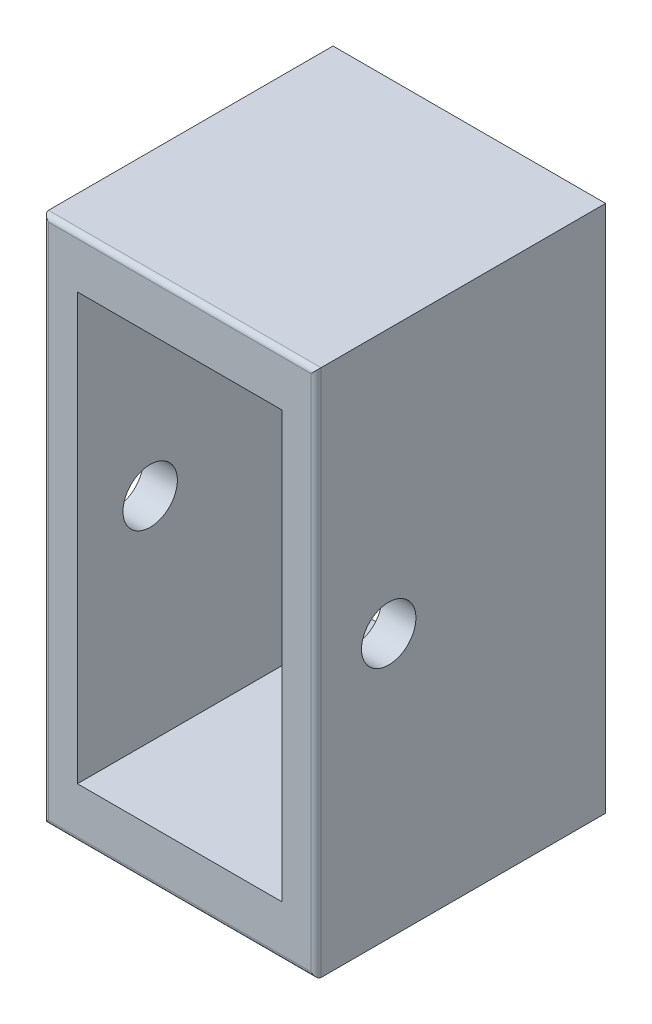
ISO-10303-21;
HEADER;
FILE_DESCRIPTION(('STEP AP214'),'2;1');
FILE_NAME('part.step','',(''),(''),'','','');
FILE_SCHEMA(('AUTOMOTIVE_DESIGN { 1 0 10303 214 1 1 1 1 }'));
ENDSEC;
DATA;
#1=APPLICATION_CONTEXT('core data for automotive mechanical design processes');
#2=APPLICATION_PROTOCOL_DEFINITION('international standard','automotive_design',2000,#1);
#3=PRODUCT_CONTEXT('',#1,'mechanical');
#4=PRODUCT('Part','Part','',(#3));
#5=PRODUCT_RELATED_PRODUCT_CATEGORY('part','',(#4));
#6=PRODUCT_DEFINITION_FORMATION('','',#4);
#7=PRODUCT_DEFINITION_CONTEXT('part definition',#1,'design');
#8=PRODUCT_DEFINITION('design','',#6,#7);
#9=PRODUCT_DEFINITION_SHAPE('','',#8);
#10=(LENGTH_UNIT() NAMED_UNIT(*) SI_UNIT(.MILLI.,.METRE.));
#11=(NAMED_UNIT(*) PLANE_ANGLE_UNIT() SI_UNIT($,.RADIAN.));
#12=(NAMED_UNIT(*) SI_UNIT($,.STERADIAN.) SOLID_ANGLE_UNIT());
#13=UNCERTAINTY_MEASURE_WITH_UNIT(LENGTH_MEASURE(1.E-05),#10,'distance_accuracy_value','');
#14=(GEOMETRIC_REPRESENTATION_CONTEXT(3) GLOBAL_UNCERTAINTY_ASSIGNED_CONTEXT((#13)) GLOBAL_UNIT_ASSIGNED_CONTEXT((#10,
#11,#12)) REPRESENTATION_CONTEXT('',''));
#15=CARTESIAN_POINT('',(0.,0.,0.));
#16=DIRECTION('',(0.,0.,1.));
#17=DIRECTION('',(1.,0.,0.));
#18=AXIS2_PLACEMENT_3D('',#15,#16,#17);
#19=CARTESIAN_POINT('',(0.,31.,17.));
#20=DIRECTION('',(0.,0.,-1.));
#21=DIRECTION('',(-1.,0.,0.));
#22=AXIS2_PLACEMENT_3D('',#19,#20,#21);
#23=PLANE('',#22);
#24=DIRECTION('',(-1.,0.,0.));
#25=VECTOR('',#24,1.);
#26=CARTESIAN_POINT('',(0.,30.7,17.));
#27=LINE('',#26,#25);
#28=CARTESIAN_POINT('',(15.7,30.7,17.));
#29=VERTEX_POINT('',#28);
#30=CARTESIAN_POINT('',(0.3,30.7,17.));
#31=VERTEX_POINT('',#30);
#32=EDGE_CURVE('E175',#29,#31,#27,.T.);
#33=ORIENTED_EDGE('',*,*,#32,.T.);
#34=DIRECTION('',(0.,-1.,0.));
#35=VECTOR('',#34,1.);
#36=CARTESIAN_POINT('',(0.3,31.,17.));
#37=LINE('',#36,#35);
#38=CARTESIAN_POINT('',(0.3,0.300000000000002,17.));
#39=VERTEX_POINT('',#38);
#40=EDGE_CURVE('E181',#31,#39,#37,.T.);
#41=ORIENTED_EDGE('',*,*,#40,.T.);
#42=DIRECTION('',(1.,0.,0.));
#43=VECTOR('',#42,1.);
#44=CARTESIAN_POINT('',(0.,0.300000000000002,17.));
#45=LINE('',#44,#43);
#46=CARTESIAN_POINT('',(15.7,0.300000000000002,17.));
#47=VERTEX_POINT('',#46);
#48=EDGE_CURVE('E179',#39,#47,#45,.T.);
#49=ORIENTED_EDGE('',*,*,#48,.T.);
#50=DIRECTION('',(0.,1.,0.));
#51=VECTOR('',#50,1.);
#52=CARTESIAN_POINT('',(15.7,31.,17.));
#53=LINE('',#52,#51);
#54=EDGE_CURVE('E177',#47,#29,#53,.T.);
#55=ORIENTED_EDGE('',*,*,#54,.T.);
#56=EDGE_LOOP('',(#33,#41,#49,#55));
#57=FACE_BOUND('',#56,.T.);
#58=DIRECTION('',(-1.,0.,0.));
#59=VECTOR('',#58,1.);
#60=CARTESIAN_POINT('',(2.,28.,17.));
#61=LINE('',#60,#59);
#62=CARTESIAN_POINT('',(14.,28.,17.));
#63=VERTEX_POINT('',#62);
#64=CARTESIAN_POINT('',(2.,28.,17.));
#65=VERTEX_POINT('',#64);
#66=EDGE_CURVE('E127',#63,#65,#61,.T.);
#67=ORIENTED_EDGE('',*,*,#66,.F.);
#68=DIRECTION('',(0.,1.,0.));
#69=VECTOR('',#68,1.);
#70=CARTESIAN_POINT('',(14.,3.,17.));
#71=LINE('',#70,#69);
#72=CARTESIAN_POINT('',(14.,3.,17.));
#73=VERTEX_POINT('',#72);
#74=EDGE_CURVE('E149',#73,#63,#71,.T.);
#75=ORIENTED_EDGE('',*,*,#74,.F.);
#76=DIRECTION('',(1.,0.,0.));
#77=VECTOR('',#76,1.);
#78=CARTESIAN_POINT('',(2.,3.,17.));
#79=LINE('',#78,#77);
#80=CARTESIAN_POINT('',(2.,3.,17.));
#81=VERTEX_POINT('',#80);
#82=EDGE_CURVE('E146',#81,#73,#79,.T.);
#83=ORIENTED_EDGE('',*,*,#82,.F.);
#84=DIRECTION('',(0.,-1.,0.));
#85=VECTOR('',#84,1.);
#86=CARTESIAN_POINT('',(2.,3.,17.));
#87=LINE('',#86,#85);
#88=EDGE_CURVE('E144',#65,#81,#87,.T.);
#89=ORIENTED_EDGE('',*,*,#88,.F.);
#90=EDGE_LOOP('',(#67,#75,#83,#89));
#91=FACE_BOUND('',#90,.T.);
#92=ADVANCED_FACE('F32',(#57,#91),#23,.F.);
#93=CARTESIAN_POINT('',(0.,31.,0.));
#94=DIRECTION('',(0.,0.,-1.));
#95=DIRECTION('',(-1.,0.,0.));
#96=AXIS2_PLACEMENT_3D('',#93,#94,#95);
#97=PLANE('',#96);
#98=DIRECTION('',(0.,-1.,0.));
#99=VECTOR('',#98,1.);
#100=CARTESIAN_POINT('',(0.,0.,0.));
#101=LINE('',#100,#99);
#102=CARTESIAN_POINT('',(0.,31.,0.));
#103=VERTEX_POINT('',#102);
#104=CARTESIAN_POINT('',(0.,0.,0.));
#105=VERTEX_POINT('',#104);
#106=EDGE_CURVE('E128',#103,#105,#101,.T.);
#107=ORIENTED_EDGE('',*,*,#106,.F.);
#108=DIRECTION('',(-1.,0.,0.));
#109=VECTOR('',#108,1.);
#110=CARTESIAN_POINT('',(0.,31.,0.));
#111=LINE('',#110,#109);
#112=CARTESIAN_POINT('',(16.,31.,0.));
#113=VERTEX_POINT('',#112);
#114=EDGE_CURVE('E164',#113,#103,#111,.T.);
#115=ORIENTED_EDGE('',*,*,#114,.F.);
#116=DIRECTION('',(0.,1.,0.));
#117=VECTOR('',#116,1.);
#118=CARTESIAN_POINT('',(16.,0.,0.));
#119=LINE('',#118,#117);
#120=CARTESIAN_POINT('',(16.,0.,0.));
#121=VERTEX_POINT('',#120);
#122=EDGE_CURVE('E161',#121,#113,#119,.T.);
#123=ORIENTED_EDGE('',*,*,#122,.F.);
#124=DIRECTION('',(1.,0.,0.));
#125=VECTOR('',#124,1.);
#126=CARTESIAN_POINT('',(0.,0.,0.));
#127=LINE('',#126,#125);
#128=EDGE_CURVE('E158',#105,#121,#127,.T.);
#129=ORIENTED_EDGE('',*,*,#128,.F.);
#130=EDGE_LOOP('',(#107,#115,#123,#129));
#131=FACE_BOUND('',#130,.T.);
#132=DIRECTION('',(0.,1.,0.));
#133=VECTOR('',#132,1.);
#134=CARTESIAN_POINT('',(14.,3.,0.));
#135=LINE('',#134,#133);
#136=CARTESIAN_POINT('',(14.,3.,0.));
#137=VERTEX_POINT('',#136);
#138=CARTESIAN_POINT('',(14.,28.,0.));
#139=VERTEX_POINT('',#138);
#140=EDGE_CURVE('E133',#137,#139,#135,.T.);
#141=ORIENTED_EDGE('',*,*,#140,.T.);
#142=DIRECTION('',(-1.,0.,0.));
#143=VECTOR('',#142,1.);
#144=CARTESIAN_POINT('',(2.,28.,0.));
#145=LINE('',#144,#143);
#146=CARTESIAN_POINT('',(2.,28.,0.));
#147=VERTEX_POINT('',#146);
#148=EDGE_CURVE('E120',#139,#147,#145,.T.);
#149=ORIENTED_EDGE('',*,*,#148,.T.);
#150=DIRECTION('',(0.,-1.,0.));
#151=VECTOR('',#150,1.);
#152=CARTESIAN_POINT('',(2.,3.,0.));
#153=LINE('',#152,#151);
#154=CARTESIAN_POINT('',(2.,3.,0.));
#155=VERTEX_POINT('',#154);
#156=EDGE_CURVE('E108',#147,#155,#153,.T.);
#157=ORIENTED_EDGE('',*,*,#156,.T.);
#158=DIRECTION('',(1.,0.,0.));
#159=VECTOR('',#158,1.);
#160=CARTESIAN_POINT('',(2.,3.,0.));
#161=LINE('',#160,#159);
#162=EDGE_CURVE('E119',#155,#137,#161,.T.);
#163=ORIENTED_EDGE('',*,*,#162,.T.);
#164=EDGE_LOOP('',(#141,#149,#157,#163));
#165=FACE_BOUND('',#164,.T.);
#166=ADVANCED_FACE('F131',(#131,#165),#97,.T.);
#167=CARTESIAN_POINT('',(0.,0.,17.));
#168=DIRECTION('',(1.,0.,0.));
#169=DIRECTION('',(0.,0.,-1.));
#170=AXIS2_PLACEMENT_3D('',#167,#168,#169);
#171=PLANE('',#170);
#172=CARTESIAN_POINT('',(0.,15.5,12.7319563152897));
#173=DIRECTION('',(1.,0.,0.));
#174=DIRECTION('',(0.,0.,-1.));
#175=AXIS2_PLACEMENT_3D('',#172,#173,#174);
#176=CIRCLE('',#175,1.5977138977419);
#177=CARTESIAN_POINT('',(0.,15.5,11.1342424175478));
#178=VERTEX_POINT('',#177);
#179=EDGE_CURVE('E257',#178,#178,#176,.T.);
#180=ORIENTED_EDGE('',*,*,#179,.T.);
#181=EDGE_LOOP('',(#180));
#182=FACE_BOUND('',#181,.T.);
#183=DIRECTION('',(0.,0.,-1.));
#184=VECTOR('',#183,1.);
#185=CARTESIAN_POINT('',(0.,0.,17.));
#186=LINE('',#185,#184);
#187=CARTESIAN_POINT('',(0.,0.,16.7));
#188=VERTEX_POINT('',#187);
#189=EDGE_CURVE('E173',#188,#105,#186,.T.);
#190=ORIENTED_EDGE('',*,*,#189,.F.);
#191=DIRECTION('',(0.,-1.,0.));
#192=VECTOR('',#191,1.);
#193=CARTESIAN_POINT('',(0.,0.,16.7));
#194=LINE('',#193,#192);
#195=CARTESIAN_POINT('',(0.,31.,16.7));
#196=VERTEX_POINT('',#195);
#197=EDGE_CURVE('E184',#188,#196,#194,.F.);
#198=ORIENTED_EDGE('',*,*,#197,.T.);
#199=DIRECTION('',(0.,0.,-1.));
#200=VECTOR('',#199,1.);
#201=CARTESIAN_POINT('',(0.,31.,17.));
#202=LINE('',#201,#200);
#203=EDGE_CURVE('E167',#196,#103,#202,.T.);
#204=ORIENTED_EDGE('',*,*,#203,.T.);
#205=ORIENTED_EDGE('',*,*,#106,.T.);
#206=EDGE_LOOP('',(#190,#198,#204,#205));
#207=FACE_BOUND('',#206,.T.);
#208=ADVANCED_FACE('F34',(#182,#207),#171,.F.);
#209=CARTESIAN_POINT('',(0.,0.,17.));
#210=DIRECTION('',(0.,1.,0.));
#211=DIRECTION('',(0.,0.,1.));
#212=AXIS2_PLACEMENT_3D('',#209,#210,#211);
#213=PLANE('',#212);
#214=DIRECTION('',(0.,0.,-1.));
#215=VECTOR('',#214,1.);
#216=CARTESIAN_POINT('',(16.,0.,17.));
#217=LINE('',#216,#215);
#218=CARTESIAN_POINT('',(16.,0.,16.7));
#219=VERTEX_POINT('',#218);
#220=EDGE_CURVE('E171',#219,#121,#217,.T.);
#221=ORIENTED_EDGE('',*,*,#220,.F.);
#222=DIRECTION('',(1.,0.,0.));
#223=VECTOR('',#222,1.);
#224=CARTESIAN_POINT('',(0.,0.,16.7));
#225=LINE('',#224,#223);
#226=EDGE_CURVE('E187',#219,#188,#225,.F.);
#227=ORIENTED_EDGE('',*,*,#226,.T.);
#228=ORIENTED_EDGE('',*,*,#189,.T.);
#229=ORIENTED_EDGE('',*,*,#128,.T.);
#230=EDGE_LOOP('',(#221,#227,#228,#229));
#231=FACE_BOUND('',#230,.T.);
#232=ADVANCED_FACE('F192',(#231),#213,.F.);
#233=CARTESIAN_POINT('',(16.,0.,17.));
#234=DIRECTION('',(-1.,0.,0.));
#235=DIRECTION('',(0.,0.,1.));
#236=AXIS2_PLACEMENT_3D('',#233,#234,#235);
#237=PLANE('',#236);
#238=CARTESIAN_POINT('',(16.,15.5,12.7319563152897));
#239=DIRECTION('',(1.,0.,0.));
#240=DIRECTION('',(0.,0.,-1.));
#241=AXIS2_PLACEMENT_3D('',#238,#239,#240);
#242=CIRCLE('',#241,1.5977138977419);
#243=CARTESIAN_POINT('',(16.,15.5,11.1342424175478));
#244=VERTEX_POINT('',#243);
#245=EDGE_CURVE('E259',#244,#244,#242,.T.);
#246=ORIENTED_EDGE('',*,*,#245,.F.);
#247=EDGE_LOOP('',(#246));
#248=FACE_BOUND('',#247,.T.);
#249=DIRECTION('',(0.,0.,-1.));
#250=VECTOR('',#249,1.);
#251=CARTESIAN_POINT('',(16.,31.,17.));
#252=LINE('',#251,#250);
#253=CARTESIAN_POINT('',(16.,31.,16.7));
#254=VERTEX_POINT('',#253);
#255=EDGE_CURVE('E169',#254,#113,#252,.T.);
#256=ORIENTED_EDGE('',*,*,#255,.F.);
#257=DIRECTION('',(0.,1.,0.));
#258=VECTOR('',#257,1.);
#259=CARTESIAN_POINT('',(16.,0.,16.7));
#260=LINE('',#259,#258);
#261=EDGE_CURVE('E41',#254,#219,#260,.F.);
#262=ORIENTED_EDGE('',*,*,#261,.T.);
#263=ORIENTED_EDGE('',*,*,#220,.T.);
#264=ORIENTED_EDGE('',*,*,#122,.T.);
#265=EDGE_LOOP('',(#256,#262,#263,#264));
#266=FACE_BOUND('',#265,.T.);
#267=ADVANCED_FACE('F245',(#248,#266),#237,.F.);
#268=CARTESIAN_POINT('',(0.,31.,17.));
#269=DIRECTION('',(0.,-1.,0.));
#270=DIRECTION('',(0.,0.,-1.));
#271=AXIS2_PLACEMENT_3D('',#268,#269,#270);
#272=PLANE('',#271);
#273=ORIENTED_EDGE('',*,*,#203,.F.);
#274=DIRECTION('',(-1.,0.,0.));
#275=VECTOR('',#274,1.);
#276=CARTESIAN_POINT('',(0.,31.,16.7));
#277=LINE('',#276,#275);
#278=EDGE_CURVE('E11',#196,#254,#277,.F.);
#279=ORIENTED_EDGE('',*,*,#278,.T.);
#280=ORIENTED_EDGE('',*,*,#255,.T.);
#281=ORIENTED_EDGE('',*,*,#114,.T.);
#282=EDGE_LOOP('',(#273,#279,#280,#281));
#283=FACE_BOUND('',#282,.T.);
#284=ADVANCED_FACE('F242',(#283),#272,.F.);
#285=CARTESIAN_POINT('',(2.,28.,17.));
#286=DIRECTION('',(0.,-1.,0.));
#287=DIRECTION('',(0.,0.,-1.));
#288=AXIS2_PLACEMENT_3D('',#285,#286,#287);
#289=PLANE('',#288);
#290=ORIENTED_EDGE('',*,*,#148,.F.);
#291=DIRECTION('',(0.,0.,-1.));
#292=VECTOR('',#291,1.);
#293=CARTESIAN_POINT('',(14.,28.,17.));
#294=LINE('',#293,#292);
#295=EDGE_CURVE('E151',#63,#139,#294,.T.);
#296=ORIENTED_EDGE('',*,*,#295,.F.);
#297=ORIENTED_EDGE('',*,*,#66,.T.);
#298=DIRECTION('',(0.,0.,-1.));
#299=VECTOR('',#298,1.);
#300=CARTESIAN_POINT('',(2.,28.,17.));
#301=LINE('',#300,#299);
#302=EDGE_CURVE('E111',#65,#147,#301,.T.);
#303=ORIENTED_EDGE('',*,*,#302,.T.);
#304=EDGE_LOOP('',(#290,#296,#297,#303));
#305=FACE_BOUND('',#304,.T.);
#306=ADVANCED_FACE('F123',(#305),#289,.T.);
#307=CARTESIAN_POINT('',(2.,3.,17.));
#308=DIRECTION('',(1.,0.,0.));
#309=DIRECTION('',(0.,0.,-1.));
#310=AXIS2_PLACEMENT_3D('',#307,#308,#309);
#311=PLANE('',#310);
#312=CARTESIAN_POINT('',(2.,15.5,12.7319563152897));
#313=DIRECTION('',(1.,0.,0.));
#314=DIRECTION('',(0.,0.,-1.));
#315=AXIS2_PLACEMENT_3D('',#312,#313,#314);
#316=CIRCLE('',#315,1.5977138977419);
#317=CARTESIAN_POINT('',(2.,15.5,11.1342424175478));
#318=VERTEX_POINT('',#317);
#319=EDGE_CURVE('E209',#318,#318,#316,.T.);
#320=ORIENTED_EDGE('',*,*,#319,.F.);
#321=EDGE_LOOP('',(#320));
#322=FACE_BOUND('',#321,.T.);
#323=ORIENTED_EDGE('',*,*,#156,.F.);
#324=ORIENTED_EDGE('',*,*,#302,.F.);
#325=ORIENTED_EDGE('',*,*,#88,.T.);
#326=DIRECTION('',(0.,0.,-1.));
#327=VECTOR('',#326,1.);
#328=CARTESIAN_POINT('',(2.,3.,17.));
#329=LINE('',#328,#327);
#330=EDGE_CURVE('E114',#81,#155,#329,.T.);
#331=ORIENTED_EDGE('',*,*,#330,.T.);
#332=EDGE_LOOP('',(#323,#324,#325,#331));
#333=FACE_BOUND('',#332,.T.);
#334=ADVANCED_FACE('F110',(#322,#333),#311,.T.);
#335=CARTESIAN_POINT('',(2.,3.,17.));
#336=DIRECTION('',(0.,1.,0.));
#337=DIRECTION('',(0.,0.,1.));
#338=AXIS2_PLACEMENT_3D('',#335,#336,#337);
#339=PLANE('',#338);
#340=ORIENTED_EDGE('',*,*,#162,.F.);
#341=ORIENTED_EDGE('',*,*,#330,.F.);
#342=ORIENTED_EDGE('',*,*,#82,.T.);
#343=DIRECTION('',(0.,0.,-1.));
#344=VECTOR('',#343,1.);
#345=CARTESIAN_POINT('',(14.,3.,17.));
#346=LINE('',#345,#344);
#347=EDGE_CURVE('E153',#73,#137,#346,.T.);
#348=ORIENTED_EDGE('',*,*,#347,.T.);
#349=EDGE_LOOP('',(#340,#341,#342,#348));
#350=FACE_BOUND('',#349,.T.);
#351=ADVANCED_FACE('F282',(#350),#339,.T.);
#352=CARTESIAN_POINT('',(14.,3.,17.));
#353=DIRECTION('',(-1.,0.,0.));
#354=DIRECTION('',(0.,0.,1.));
#355=AXIS2_PLACEMENT_3D('',#352,#353,#354);
#356=PLANE('',#355);
#357=CARTESIAN_POINT('',(14.,15.5,12.7319563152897));
#358=DIRECTION('',(-1.,0.,0.));
#359=DIRECTION('',(0.,0.,1.));
#360=AXIS2_PLACEMENT_3D('',#357,#358,#359);
#361=CIRCLE('',#360,1.5977138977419);
#362=CARTESIAN_POINT('',(14.,15.5,14.3296702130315));
#363=VERTEX_POINT('',#362);
#364=EDGE_CURVE('E36',#363,#363,#361,.T.);
#365=ORIENTED_EDGE('',*,*,#364,.F.);
#366=EDGE_LOOP('',(#365));
#367=FACE_BOUND('',#366,.T.);
#368=ORIENTED_EDGE('',*,*,#140,.F.);
#369=ORIENTED_EDGE('',*,*,#347,.F.);
#370=ORIENTED_EDGE('',*,*,#74,.T.);
#371=ORIENTED_EDGE('',*,*,#295,.T.);
#372=EDGE_LOOP('',(#368,#369,#370,#371));
#373=FACE_BOUND('',#372,.T.);
#374=ADVANCED_FACE('F231',(#367,#373),#356,.T.);
#375=CARTESIAN_POINT('',(15.7,31.,16.7));
#376=DIRECTION('',(0.,1.,0.));
#377=DIRECTION('',(0.,0.,1.));
#378=AXIS2_PLACEMENT_3D('',#375,#376,#377);
#379=CYLINDRICAL_SURFACE('',#378,0.3);
#380=CARTESIAN_POINT('',(15.7,0.300000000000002,16.7));
#381=DIRECTION('',(0.707106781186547,0.707106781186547,0.));
#382=DIRECTION('',(-0.707106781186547,0.707106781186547,0.));
#383=AXIS2_PLACEMENT_3D('',#380,#381,#382);
#384=ELLIPSE('',#383,0.424264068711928,0.3);
#385=EDGE_CURVE('E137',#219,#47,#384,.F.);
#386=ORIENTED_EDGE('',*,*,#385,.F.);
#387=ORIENTED_EDGE('',*,*,#261,.F.);
#388=CARTESIAN_POINT('',(15.7,30.7,16.7));
#389=DIRECTION('',(-0.707106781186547,0.707106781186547,0.));
#390=DIRECTION('',(-0.707106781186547,-0.707106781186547,0.));
#391=AXIS2_PLACEMENT_3D('',#388,#389,#390);
#392=ELLIPSE('',#391,0.424264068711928,0.3);
#393=EDGE_CURVE('E134',#29,#254,#392,.T.);
#394=ORIENTED_EDGE('',*,*,#393,.F.);
#395=ORIENTED_EDGE('',*,*,#54,.F.);
#396=EDGE_LOOP('',(#386,#387,#394,#395));
#397=FACE_BOUND('',#396,.T.);
#398=ADVANCED_FACE('F217',(#397),#379,.T.);
#399=CARTESIAN_POINT('',(0.,30.7,16.7));
#400=DIRECTION('',(-1.,0.,0.));
#401=DIRECTION('',(0.,0.,1.));
#402=AXIS2_PLACEMENT_3D('',#399,#400,#401);
#403=CYLINDRICAL_SURFACE('',#402,0.3);
#404=ORIENTED_EDGE('',*,*,#393,.T.);
#405=ORIENTED_EDGE('',*,*,#278,.F.);
#406=CARTESIAN_POINT('',(0.3,30.7,16.7));
#407=DIRECTION('',(-0.707106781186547,-0.707106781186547,0.));
#408=DIRECTION('',(-0.707106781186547,0.707106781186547,0.));
#409=AXIS2_PLACEMENT_3D('',#406,#407,#408);
#410=ELLIPSE('',#409,0.424264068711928,0.3);
#411=EDGE_CURVE('E207',#31,#196,#410,.T.);
#412=ORIENTED_EDGE('',*,*,#411,.F.);
#413=ORIENTED_EDGE('',*,*,#32,.F.);
#414=EDGE_LOOP('',(#404,#405,#412,#413));
#415=FACE_BOUND('',#414,.T.);
#416=ADVANCED_FACE('F223',(#415),#403,.T.);
#417=CARTESIAN_POINT('',(0.,0.300000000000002,16.7));
#418=DIRECTION('',(1.,0.,0.));
#419=DIRECTION('',(0.,0.,-1.));
#420=AXIS2_PLACEMENT_3D('',#417,#418,#419);
#421=CYLINDRICAL_SURFACE('',#420,0.3);
#422=ORIENTED_EDGE('',*,*,#385,.T.);
#423=ORIENTED_EDGE('',*,*,#48,.F.);
#424=CARTESIAN_POINT('',(0.3,0.300000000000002,16.7));
#425=DIRECTION('',(0.707106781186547,-0.707106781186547,0.));
#426=DIRECTION('',(0.707106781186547,0.707106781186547,0.));
#427=AXIS2_PLACEMENT_3D('',#424,#425,#426);
#428=ELLIPSE('',#427,0.424264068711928,0.3);
#429=EDGE_CURVE('E204',#188,#39,#428,.F.);
#430=ORIENTED_EDGE('',*,*,#429,.F.);
#431=ORIENTED_EDGE('',*,*,#226,.F.);
#432=EDGE_LOOP('',(#422,#423,#430,#431));
#433=FACE_BOUND('',#432,.T.);
#434=ADVANCED_FACE('F208',(#433),#421,.T.);
#435=CARTESIAN_POINT('',(0.3,31.,16.7));
#436=DIRECTION('',(0.,-1.,0.));
#437=DIRECTION('',(0.,0.,-1.));
#438=AXIS2_PLACEMENT_3D('',#435,#436,#437);
#439=CYLINDRICAL_SURFACE('',#438,0.3);
#440=ORIENTED_EDGE('',*,*,#411,.T.);
#441=ORIENTED_EDGE('',*,*,#197,.F.);
#442=ORIENTED_EDGE('',*,*,#429,.T.);
#443=ORIENTED_EDGE('',*,*,#40,.F.);
#444=EDGE_LOOP('',(#440,#441,#442,#443));
#445=FACE_BOUND('',#444,.T.);
#446=ADVANCED_FACE('F202',(#445),#439,.T.);
#447=CARTESIAN_POINT('',(0.,15.5,12.7319563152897));
#448=DIRECTION('',(1.,0.,0.));
#449=DIRECTION('',(0.,0.,-1.));
#450=AXIS2_PLACEMENT_3D('',#447,#448,#449);
#451=CYLINDRICAL_SURFACE('',#450,1.5977138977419);
#452=ORIENTED_EDGE('',*,*,#364,.T.);
#453=EDGE_LOOP('',(#452));
#454=FACE_BOUND('',#453,.T.);
#455=ORIENTED_EDGE('',*,*,#245,.T.);
#456=EDGE_LOOP('',(#455));
#457=FACE_BOUND('',#456,.T.);
#458=ADVANCED_FACE('F265',(#454,#457),#451,.F.);
#459=ORIENTED_EDGE('',*,*,#319,.T.);
#460=EDGE_LOOP('',(#459));
#461=FACE_BOUND('',#460,.T.);
#462=ORIENTED_EDGE('',*,*,#179,.F.);
#463=EDGE_LOOP('',(#462));
#464=FACE_BOUND('',#463,.T.);
#465=ADVANCED_FACE('F269',(#461,#464),#451,.F.);
#466=CLOSED_SHELL('',(#92,#166,#208,#232,#267,#284,#306,#334,#351,#374,#398,#416,#434,#446,#458,#465));
#467=MANIFOLD_SOLID_BREP('B2',#466);
#468=ADVANCED_BREP_SHAPE_REPRESENTATION('',(#18,#467),#14);
#469=SHAPE_DEFINITION_REPRESENTATION(#9,#468);
ENDSEC;
END-ISO-10303-21;
